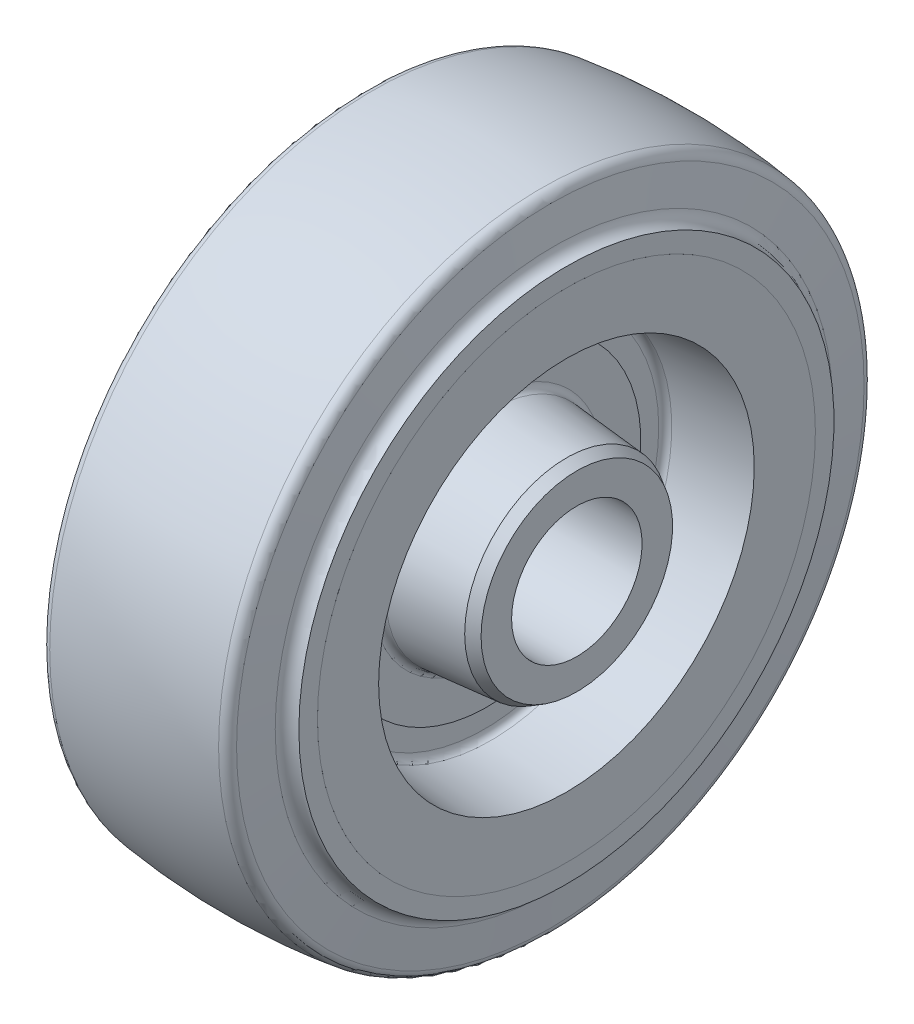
from build123d import *


with BuildPart() as part:
    # Sketch1 → Revolve1 (revolve)
    with BuildSketch(Plane.XY, mode=Mode.PRIVATE) as revolve1_sk:
        with BuildLine():
            Line((27.813, 22.225), (25.4, 23.618146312))
            Line((25.4, 23.618146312), (8.561140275, 25.091355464))
            ThreePointArc((8.561140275, 25.091355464), (7.529072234, 25.600315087), (7.112, 26.672814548))
            Line((7.112, 26.672814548), (7.112, 35.56))
            Line((7.112, 35.56), (6.35, 35.56))
            Line((6.35, 35.56), (6.35, 40.47075883))
            ThreePointArc((6.35, 40.47075883), (6.767072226, 41.543258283), (7.799140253, 42.052217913))
            Line((7.799140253, 42.052217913), (25.4, 43.592093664))
            Line((25.4, 43.592093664), (25.4, 57.785))
            Line((25.4, 57.785), (25.39746, 57.785))
            Line((25.39746, 57.785), (25.39746, 62.103))
            ThreePointArc((25.39746, 62.103), (23.456030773, 62.848244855), (22.511933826, 64.701139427))
            Line((22.511933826, 64.701139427), (21.658367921, 72.822276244))
            ThreePointArc((21.658367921, 72.822276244), (20.994229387, 74.236650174), (19.596355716, 74.934849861))
            ThreePointArc((19.596355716, 74.934849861), (0, 76.2), (-19.596355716, 74.934849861))
            ThreePointArc((-19.596355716, 74.934849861), (-20.994229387, 74.236650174), (-21.658367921, 72.822276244))
            Line((-21.658367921, 72.822276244), (-22.511933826, 64.701139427))
            ThreePointArc((-22.511933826, 64.701139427), (-23.456030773, 62.848244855), (-25.39746, 62.103))
            Line((-25.39746, 62.103), (-25.39746, 57.785))
            Line((-25.39746, 57.785), (-25.4, 57.785))
            Line((-25.4, 57.785), (-25.4, 43.592093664))
            Line((-25.4, 43.592093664), (-7.799140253, 42.052217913))
            ThreePointArc((-7.799140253, 42.052217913), (-6.767072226, 41.543258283), (-6.35, 40.47075883))
            Line((-6.35, 40.47075883), (-6.35, 35.56))
            Line((-6.35, 35.56), (-7.112, 35.56))
            Line((-7.112, 35.56), (-7.112, 26.672814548))
            ThreePointArc((-7.112, 26.672814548), (-7.529072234, 25.600315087), (-8.561140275, 25.091355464))
            Line((-8.561140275, 25.091355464), (-25.4, 23.618146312))
            Line((-25.4, 23.618146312), (-27.813, 22.225))
            Line((-27.813, 22.225), (-27.813, 15.1384))
            Line((-27.813, 15.1384), (27.813, 15.1384))
            Line((27.813, 15.1384), (27.813, 22.225))
        make_face()
    revolve(revolve1_sk.sketch.rotate(Axis((-38.862204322, 0, 0), (1, 0, 0)), 90), axis=Axis((-38.862204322, 0, 0), (1, 0, 0)))


solid = part.part
